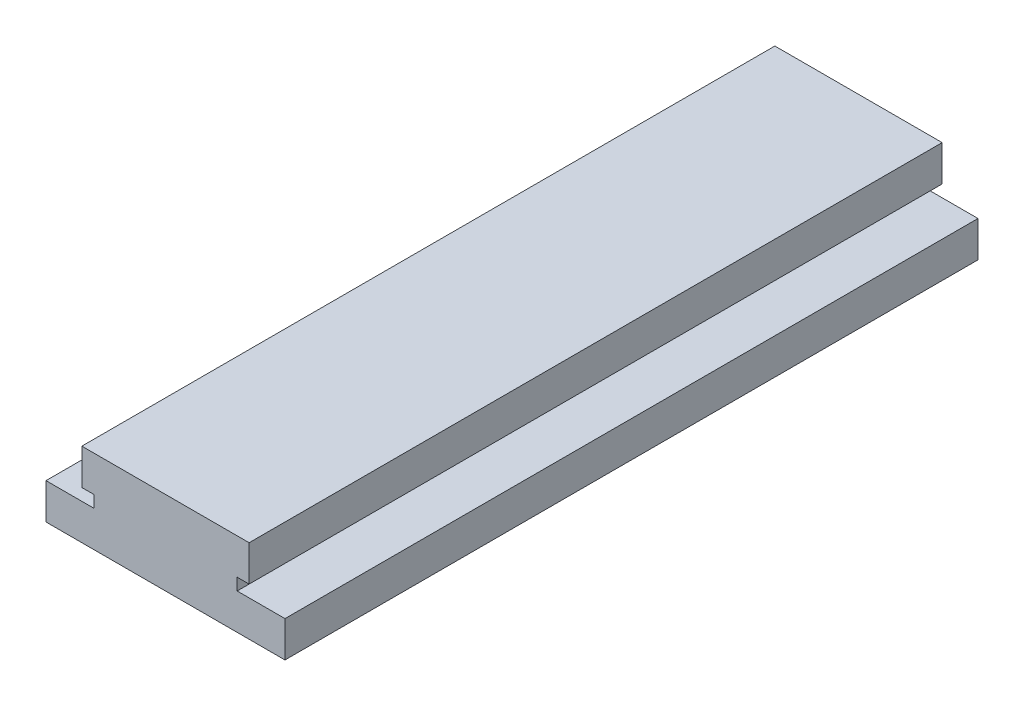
from build123d import *

# Parameters (mm, degrees)
EXTRUSION1_DEPTH      = 29
EXTRUSION1_DEPTH_BACK = 29


with BuildPart() as part:
    # Esquisse1 → Extrusion1 (new, two sides: drawn at the far end of the back side and taken through both)
    with BuildSketch(Plane.XY.offset(-EXTRUSION1_DEPTH_BACK)):
        Polygon((-10, 0), (10, 0), (10, 3), (6, 3), (6, 4), (7, 4), (7, 7), (-7, 7), (-7, 4), (-6, 4), (-6, 3), (-10, 3), align=None)
    extrude(amount=EXTRUSION1_DEPTH + EXTRUSION1_DEPTH_BACK)


solid = part.part
